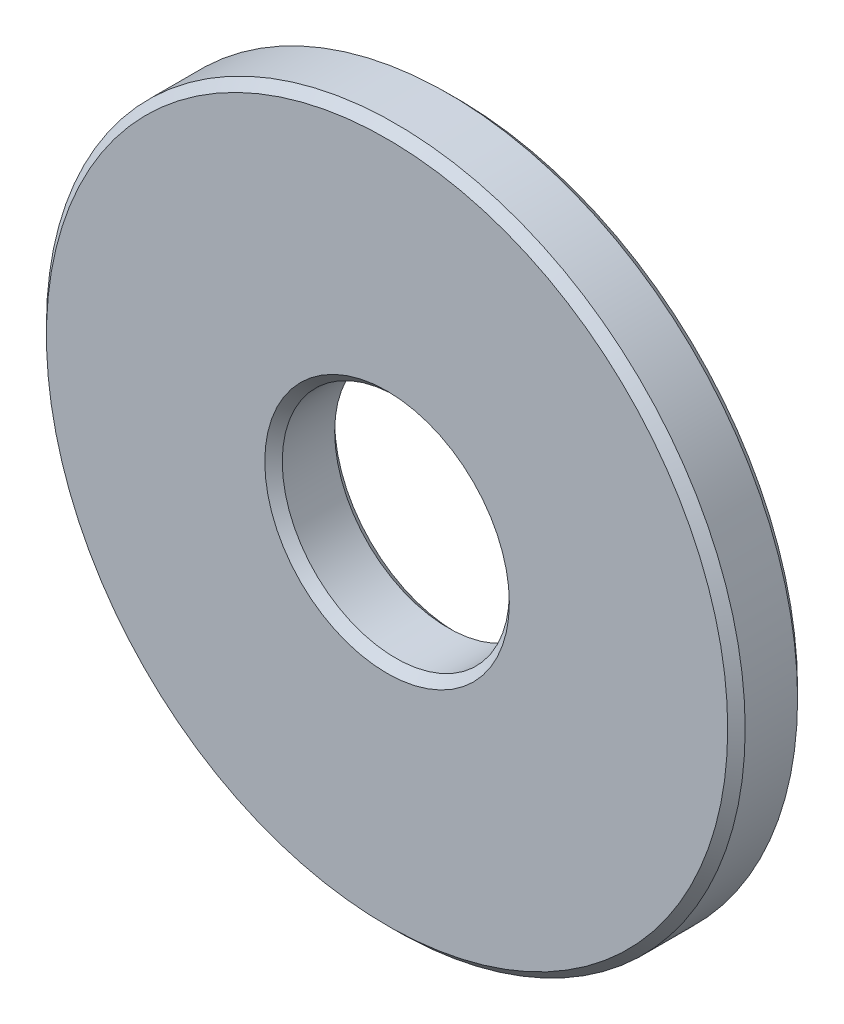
ISO-10303-21;
HEADER;
FILE_DESCRIPTION(('STEP AP214'),'2;1');
FILE_NAME('part.step','',(''),(''),'','','');
FILE_SCHEMA(('AUTOMOTIVE_DESIGN { 1 0 10303 214 1 1 1 1 }'));
ENDSEC;
DATA;
#1=APPLICATION_CONTEXT('core data for automotive mechanical design processes');
#2=APPLICATION_PROTOCOL_DEFINITION('international standard','automotive_design',2000,#1);
#3=PRODUCT_CONTEXT('',#1,'mechanical');
#4=PRODUCT('Part','Part','',(#3));
#5=PRODUCT_RELATED_PRODUCT_CATEGORY('part','',(#4));
#6=PRODUCT_DEFINITION_FORMATION('','',#4);
#7=PRODUCT_DEFINITION_CONTEXT('part definition',#1,'design');
#8=PRODUCT_DEFINITION('design','',#6,#7);
#9=PRODUCT_DEFINITION_SHAPE('','',#8);
#10=(LENGTH_UNIT() NAMED_UNIT(*) SI_UNIT(.MILLI.,.METRE.));
#11=(NAMED_UNIT(*) PLANE_ANGLE_UNIT() SI_UNIT($,.RADIAN.));
#12=(NAMED_UNIT(*) SI_UNIT($,.STERADIAN.) SOLID_ANGLE_UNIT());
#13=UNCERTAINTY_MEASURE_WITH_UNIT(LENGTH_MEASURE(1.E-05),#10,'distance_accuracy_value','');
#14=(GEOMETRIC_REPRESENTATION_CONTEXT(3) GLOBAL_UNCERTAINTY_ASSIGNED_CONTEXT((#13)) GLOBAL_UNIT_ASSIGNED_CONTEXT((#10,
#11,#12)) REPRESENTATION_CONTEXT('',''));
#15=CARTESIAN_POINT('',(0.,0.,0.));
#16=DIRECTION('',(0.,0.,1.));
#17=DIRECTION('',(1.,0.,0.));
#18=AXIS2_PLACEMENT_3D('',#15,#16,#17);
#19=CARTESIAN_POINT('',(0.,0.,-2.));
#20=DIRECTION('',(0.,0.,1.));
#21=DIRECTION('',(1.,0.,0.));
#22=AXIS2_PLACEMENT_3D('',#19,#20,#21);
#23=CYLINDRICAL_SURFACE('',#22,10.);
#24=CARTESIAN_POINT('',(0.,0.,-0.250000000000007));
#25=DIRECTION('',(0.,0.,1.));
#26=DIRECTION('',(1.,0.,0.));
#27=AXIS2_PLACEMENT_3D('',#24,#25,#26);
#28=CIRCLE('',#27,10.);
#29=CARTESIAN_POINT('',(10.,0.,-0.250000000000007));
#30=VERTEX_POINT('',#29);
#31=EDGE_CURVE('E10',#30,#30,#28,.F.);
#32=ORIENTED_EDGE('',*,*,#31,.T.);
#33=EDGE_LOOP('',(#32));
#34=FACE_BOUND('',#33,.T.);
#35=CARTESIAN_POINT('',(0.,0.,-1.74999999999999));
#36=DIRECTION('',(0.,0.,1.));
#37=DIRECTION('',(1.,0.,0.));
#38=AXIS2_PLACEMENT_3D('',#35,#36,#37);
#39=CIRCLE('',#38,10.);
#40=CARTESIAN_POINT('',(10.,0.,-1.74999999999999));
#41=VERTEX_POINT('',#40);
#42=EDGE_CURVE('E45',#41,#41,#39,.T.);
#43=ORIENTED_EDGE('',*,*,#42,.T.);
#44=EDGE_LOOP('',(#43));
#45=FACE_BOUND('',#44,.T.);
#46=ADVANCED_FACE('F39',(#34,#45),#23,.T.);
#47=CARTESIAN_POINT('',(0.,0.,-2.));
#48=DIRECTION('',(0.,0.,1.));
#49=DIRECTION('',(1.,0.,0.));
#50=AXIS2_PLACEMENT_3D('',#47,#48,#49);
#51=PLANE('',#50);
#52=CARTESIAN_POINT('',(0.,0.,-2.));
#53=DIRECTION('',(0.,0.,1.));
#54=DIRECTION('',(1.,0.,0.));
#55=AXIS2_PLACEMENT_3D('',#52,#53,#54);
#56=CIRCLE('',#55,3.5);
#57=CARTESIAN_POINT('',(3.5,0.,-2.));
#58=VERTEX_POINT('',#57);
#59=EDGE_CURVE('E49',#58,#58,#56,.T.);
#60=ORIENTED_EDGE('',*,*,#59,.T.);
#61=EDGE_LOOP('',(#60));
#62=FACE_BOUND('',#61,.T.);
#63=CARTESIAN_POINT('',(0.,0.,-2.));
#64=DIRECTION('',(0.,0.,1.));
#65=DIRECTION('',(1.,0.,0.));
#66=AXIS2_PLACEMENT_3D('',#63,#64,#65);
#67=CIRCLE('',#66,9.75);
#68=CARTESIAN_POINT('',(9.75,0.,-2.));
#69=VERTEX_POINT('',#68);
#70=EDGE_CURVE('E53',#69,#69,#67,.F.);
#71=ORIENTED_EDGE('',*,*,#70,.T.);
#72=EDGE_LOOP('',(#71));
#73=FACE_BOUND('',#72,.T.);
#74=ADVANCED_FACE('F81',(#62,#73),#51,.F.);
#75=CARTESIAN_POINT('',(0.,0.,0.));
#76=DIRECTION('',(0.,0.,1.));
#77=DIRECTION('',(1.,0.,0.));
#78=AXIS2_PLACEMENT_3D('',#75,#76,#77);
#79=PLANE('',#78);
#80=CARTESIAN_POINT('',(0.,0.,0.));
#81=DIRECTION('',(0.,0.,1.));
#82=DIRECTION('',(1.,0.,0.));
#83=AXIS2_PLACEMENT_3D('',#80,#81,#82);
#84=CIRCLE('',#83,3.5);
#85=CARTESIAN_POINT('',(3.5,0.,0.));
#86=VERTEX_POINT('',#85);
#87=EDGE_CURVE('E58',#86,#86,#84,.F.);
#88=ORIENTED_EDGE('',*,*,#87,.T.);
#89=EDGE_LOOP('',(#88));
#90=FACE_BOUND('',#89,.T.);
#91=CARTESIAN_POINT('',(0.,0.,0.));
#92=DIRECTION('',(0.,0.,1.));
#93=DIRECTION('',(1.,0.,0.));
#94=AXIS2_PLACEMENT_3D('',#91,#92,#93);
#95=CIRCLE('',#94,9.75);
#96=CARTESIAN_POINT('',(9.75,0.,0.));
#97=VERTEX_POINT('',#96);
#98=EDGE_CURVE('E61',#97,#97,#95,.T.);
#99=ORIENTED_EDGE('',*,*,#98,.T.);
#100=EDGE_LOOP('',(#99));
#101=FACE_BOUND('',#100,.T.);
#102=ADVANCED_FACE('F84',(#90,#101),#79,.T.);
#103=CARTESIAN_POINT('',(0.,0.,-2.));
#104=DIRECTION('',(0.,0.,1.));
#105=DIRECTION('',(1.,0.,0.));
#106=AXIS2_PLACEMENT_3D('',#103,#104,#105);
#107=CYLINDRICAL_SURFACE('',#106,3.25);
#108=CARTESIAN_POINT('',(0.,0.,-0.250000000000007));
#109=DIRECTION('',(0.,0.,1.));
#110=DIRECTION('',(1.,0.,0.));
#111=AXIS2_PLACEMENT_3D('',#108,#109,#110);
#112=CIRCLE('',#111,3.25);
#113=CARTESIAN_POINT('',(3.25,0.,-0.250000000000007));
#114=VERTEX_POINT('',#113);
#115=EDGE_CURVE('E64',#114,#114,#112,.T.);
#116=ORIENTED_EDGE('',*,*,#115,.T.);
#117=EDGE_LOOP('',(#116));
#118=FACE_BOUND('',#117,.T.);
#119=CARTESIAN_POINT('',(0.,0.,-1.74999999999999));
#120=DIRECTION('',(0.,0.,1.));
#121=DIRECTION('',(1.,0.,0.));
#122=AXIS2_PLACEMENT_3D('',#119,#120,#121);
#123=CIRCLE('',#122,3.25);
#124=CARTESIAN_POINT('',(3.25,0.,-1.74999999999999));
#125=VERTEX_POINT('',#124);
#126=EDGE_CURVE('E67',#125,#125,#123,.F.);
#127=ORIENTED_EDGE('',*,*,#126,.T.);
#128=EDGE_LOOP('',(#127));
#129=FACE_BOUND('',#128,.T.);
#130=ADVANCED_FACE('F71',(#118,#129),#107,.F.);
#131=CARTESIAN_POINT('',(0.,0.,-0.250000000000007));
#132=DIRECTION('',(0.,0.,1.));
#133=DIRECTION('',(1.,0.,0.));
#134=AXIS2_PLACEMENT_3D('',#131,#132,#133);
#135=CONICAL_SURFACE('',#134,3.25,0.785398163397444);
#136=ORIENTED_EDGE('',*,*,#87,.F.);
#137=EDGE_LOOP('',(#136));
#138=FACE_BOUND('',#137,.T.);
#139=ORIENTED_EDGE('',*,*,#115,.F.);
#140=EDGE_LOOP('',(#139));
#141=FACE_BOUND('',#140,.T.);
#142=ADVANCED_FACE('F77',(#138,#141),#135,.F.);
#143=CARTESIAN_POINT('',(0.,0.,-2.));
#144=DIRECTION('',(0.,0.,-1.));
#145=DIRECTION('',(-1.,0.,0.));
#146=AXIS2_PLACEMENT_3D('',#143,#144,#145);
#147=CONICAL_SURFACE('',#146,3.5,0.785398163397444);
#148=ORIENTED_EDGE('',*,*,#126,.F.);
#149=EDGE_LOOP('',(#148));
#150=FACE_BOUND('',#149,.T.);
#151=ORIENTED_EDGE('',*,*,#59,.F.);
#152=EDGE_LOOP('',(#151));
#153=FACE_BOUND('',#152,.T.);
#154=ADVANCED_FACE('F73',(#150,#153),#147,.F.);
#155=CARTESIAN_POINT('',(0.,0.,0.));
#156=DIRECTION('',(0.,0.,-1.));
#157=DIRECTION('',(-1.,0.,0.));
#158=AXIS2_PLACEMENT_3D('',#155,#156,#157);
#159=CONICAL_SURFACE('',#158,9.75,0.785398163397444);
#160=ORIENTED_EDGE('',*,*,#31,.F.);
#161=EDGE_LOOP('',(#160));
#162=FACE_BOUND('',#161,.T.);
#163=ORIENTED_EDGE('',*,*,#98,.F.);
#164=EDGE_LOOP('',(#163));
#165=FACE_BOUND('',#164,.T.);
#166=ADVANCED_FACE('F76',(#162,#165),#159,.T.);
#167=CARTESIAN_POINT('',(0.,0.,-1.74999999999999));
#168=DIRECTION('',(0.,0.,1.));
#169=DIRECTION('',(1.,0.,0.));
#170=AXIS2_PLACEMENT_3D('',#167,#168,#169);
#171=CONICAL_SURFACE('',#170,10.,0.785398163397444);
#172=ORIENTED_EDGE('',*,*,#70,.F.);
#173=EDGE_LOOP('',(#172));
#174=FACE_BOUND('',#173,.T.);
#175=ORIENTED_EDGE('',*,*,#42,.F.);
#176=EDGE_LOOP('',(#175));
#177=FACE_BOUND('',#176,.T.);
#178=ADVANCED_FACE('F87',(#174,#177),#171,.T.);
#179=CLOSED_SHELL('',(#46,#74,#102,#130,#142,#154,#166,#178));
#180=MANIFOLD_SOLID_BREP('B2',#179);
#181=ADVANCED_BREP_SHAPE_REPRESENTATION('',(#18,#180),#14);
#182=SHAPE_DEFINITION_REPRESENTATION(#9,#181);
ENDSEC;
END-ISO-10303-21;
